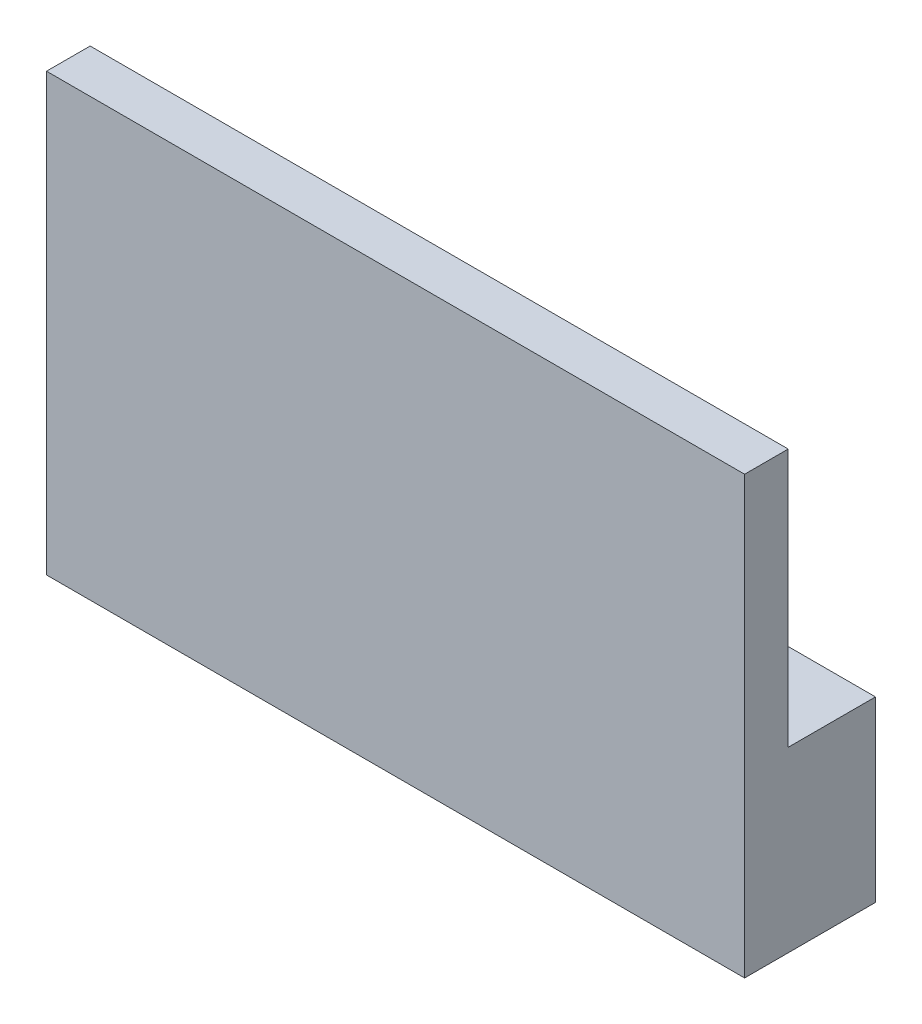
from build123d import *

# Parameters (mm, degrees)
SKETCH2_W           = 50.8
SKETCH2_H           = 31.75
BOSS_EXTRUDE1_DEPTH = 3.175
SKETCH4_W           = 50.8
SKETCH4_H           = 12.954
BOSS_EXTRUDE3_DEPTH = 6.35


with BuildPart() as part:
    # Sketch2 → Boss-Extrude1 (new body)
    with BuildSketch(Plane.XY):
        with Locations((25.4, 15.875)):
            Rectangle(SKETCH2_W, SKETCH2_H)
    extrude(amount=BOSS_EXTRUDE1_DEPTH)

    # Sketch4 → Boss-Extrude3 (add)
    with BuildSketch(Plane(origin=(0, 0, 0), x_dir=(-1, 0, 0), z_dir=(0, 0, -1))):
        with Locations((-25.4, 6.477)):
            Rectangle(SKETCH4_W, SKETCH4_H)
    extrude(amount=BOSS_EXTRUDE3_DEPTH)


solid = part.part
